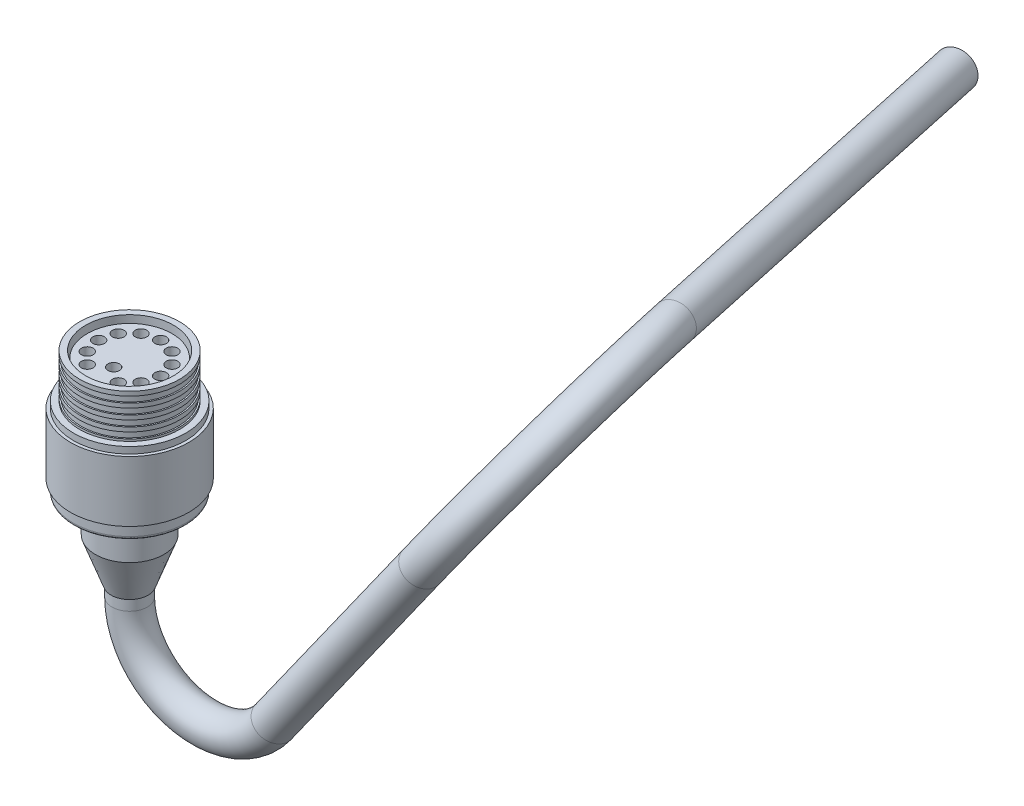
ISO-10303-21;
HEADER;
FILE_DESCRIPTION(('STEP AP214'),'2;1');
FILE_NAME('part.step','',(''),(''),'','','');
FILE_SCHEMA(('AUTOMOTIVE_DESIGN { 1 0 10303 214 1 1 1 1 }'));
ENDSEC;
DATA;
#1=APPLICATION_CONTEXT('core data for automotive mechanical design processes');
#2=APPLICATION_PROTOCOL_DEFINITION('international standard','automotive_design',2000,#1);
#3=PRODUCT_CONTEXT('',#1,'mechanical');
#4=PRODUCT('Part','Part','',(#3));
#5=PRODUCT_RELATED_PRODUCT_CATEGORY('part','',(#4));
#6=PRODUCT_DEFINITION_FORMATION('','',#4);
#7=PRODUCT_DEFINITION_CONTEXT('part definition',#1,'design');
#8=PRODUCT_DEFINITION('design','',#6,#7);
#9=PRODUCT_DEFINITION_SHAPE('','',#8);
#10=(LENGTH_UNIT() NAMED_UNIT(*) SI_UNIT(.MILLI.,.METRE.));
#11=(NAMED_UNIT(*) PLANE_ANGLE_UNIT() SI_UNIT($,.RADIAN.));
#12=(NAMED_UNIT(*) SI_UNIT($,.STERADIAN.) SOLID_ANGLE_UNIT());
#13=UNCERTAINTY_MEASURE_WITH_UNIT(LENGTH_MEASURE(1.E-05),#10,'distance_accuracy_value','');
#14=(GEOMETRIC_REPRESENTATION_CONTEXT(3) GLOBAL_UNCERTAINTY_ASSIGNED_CONTEXT((#13)) GLOBAL_UNIT_ASSIGNED_CONTEXT((#10,
#11,#12)) REPRESENTATION_CONTEXT('',''));
#15=CARTESIAN_POINT('',(0.,0.,0.));
#16=DIRECTION('',(0.,0.,1.));
#17=DIRECTION('',(1.,0.,0.));
#18=AXIS2_PLACEMENT_3D('',#15,#16,#17);
#19=CARTESIAN_POINT('',(0.,0.,0.));
#20=DIRECTION('',(0.,1.,0.));
#21=DIRECTION('',(0.,0.,1.));
#22=AXIS2_PLACEMENT_3D('',#19,#20,#21);
#23=CYLINDRICAL_SURFACE('',#22,12.954);
#24=CARTESIAN_POINT('',(0.,10.2451785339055,0.));
#25=DIRECTION('',(0.,1.,0.));
#26=DIRECTION('',(0.,0.,1.));
#27=AXIS2_PLACEMENT_3D('',#24,#25,#26);
#28=CIRCLE('',#27,12.954);
#29=CARTESIAN_POINT('',(0.,10.2451785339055,12.954));
#30=VERTEX_POINT('',#29);
#31=EDGE_CURVE('E143',#30,#30,#28,.T.);
#32=ORIENTED_EDGE('',*,*,#31,.F.);
#33=EDGE_LOOP('',(#32));
#34=FACE_BOUND('',#33,.T.);
#35=CARTESIAN_POINT('',(0.,14.5631785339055,0.));
#36=DIRECTION('',(0.,1.,0.));
#37=DIRECTION('',(0.,0.,1.));
#38=AXIS2_PLACEMENT_3D('',#35,#36,#37);
#39=CIRCLE('',#38,12.954);
#40=CARTESIAN_POINT('',(0.,14.5631785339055,12.954));
#41=VERTEX_POINT('',#40);
#42=EDGE_CURVE('E11',#41,#41,#39,.T.);
#43=ORIENTED_EDGE('',*,*,#42,.T.);
#44=EDGE_LOOP('',(#43));
#45=FACE_BOUND('',#44,.T.);
#46=ADVANCED_FACE('F46',(#34,#45),#23,.F.);
#47=CARTESIAN_POINT('',(12.954,14.5631785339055,0.));
#48=DIRECTION('',(0.,1.,0.));
#49=DIRECTION('',(0.,0.,1.));
#50=AXIS2_PLACEMENT_3D('',#47,#48,#49);
#51=PLANE('',#50);
#52=ORIENTED_EDGE('',*,*,#42,.F.);
#53=EDGE_LOOP('',(#52));
#54=FACE_BOUND('',#53,.T.);
#55=CARTESIAN_POINT('',(0.,14.5631785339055,0.));
#56=DIRECTION('',(0.,1.,0.));
#57=DIRECTION('',(0.,0.,1.));
#58=AXIS2_PLACEMENT_3D('',#55,#56,#57);
#59=CIRCLE('',#58,11.6205);
#60=CARTESIAN_POINT('',(0.,14.5631785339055,11.6205));
#61=VERTEX_POINT('',#60);
#62=EDGE_CURVE('E52',#61,#61,#59,.T.);
#63=ORIENTED_EDGE('',*,*,#62,.T.);
#64=EDGE_LOOP('',(#63));
#65=FACE_BOUND('',#64,.T.);
#66=ADVANCED_FACE('F150',(#54,#65),#51,.F.);
#67=CARTESIAN_POINT('',(0.,0.,0.));
#68=DIRECTION('',(0.,1.,0.));
#69=DIRECTION('',(0.,0.,1.));
#70=AXIS2_PLACEMENT_3D('',#67,#68,#69);
#71=CYLINDRICAL_SURFACE('',#70,11.6205);
#72=ORIENTED_EDGE('',*,*,#62,.F.);
#73=EDGE_LOOP('',(#72));
#74=FACE_BOUND('',#73,.T.);
#75=CARTESIAN_POINT('',(0.,15.4440239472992,0.));
#76=DIRECTION('',(0.,1.,0.));
#77=DIRECTION('',(0.,0.,1.));
#78=AXIS2_PLACEMENT_3D('',#75,#76,#77);
#79=CIRCLE('',#78,11.6205);
#80=CARTESIAN_POINT('',(0.,15.4440239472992,11.6205));
#81=VERTEX_POINT('',#80);
#82=EDGE_CURVE('E56',#81,#81,#79,.T.);
#83=ORIENTED_EDGE('',*,*,#82,.T.);
#84=EDGE_LOOP('',(#83));
#85=FACE_BOUND('',#84,.T.);
#86=ADVANCED_FACE('F154',(#74,#85),#71,.F.);
#87=CARTESIAN_POINT('',(11.6205,15.4440239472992,0.));
#88=DIRECTION('',(0.,-1.,0.));
#89=DIRECTION('',(0.,0.,-1.));
#90=AXIS2_PLACEMENT_3D('',#87,#88,#89);
#91=PLANE('',#90);
#92=ORIENTED_EDGE('',*,*,#82,.F.);
#93=EDGE_LOOP('',(#92));
#94=FACE_BOUND('',#93,.T.);
#95=CARTESIAN_POINT('',(0.,15.4440239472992,0.));
#96=DIRECTION('',(0.,1.,0.));
#97=DIRECTION('',(0.,0.,1.));
#98=AXIS2_PLACEMENT_3D('',#95,#96,#97);
#99=CIRCLE('',#98,12.954);
#100=CARTESIAN_POINT('',(0.,15.4440239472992,12.954));
#101=VERTEX_POINT('',#100);
#102=EDGE_CURVE('E60',#101,#101,#99,.T.);
#103=ORIENTED_EDGE('',*,*,#102,.T.);
#104=EDGE_LOOP('',(#103));
#105=FACE_BOUND('',#104,.T.);
#106=ADVANCED_FACE('F159',(#94,#105),#91,.F.);
#107=CARTESIAN_POINT('',(0.,0.,0.));
#108=DIRECTION('',(0.,1.,0.));
#109=DIRECTION('',(0.,0.,1.));
#110=AXIS2_PLACEMENT_3D('',#107,#108,#109);
#111=CYLINDRICAL_SURFACE('',#110,12.954);
#112=ORIENTED_EDGE('',*,*,#102,.F.);
#113=EDGE_LOOP('',(#112));
#114=FACE_BOUND('',#113,.T.);
#115=CARTESIAN_POINT('',(0.,47.0751785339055,0.));
#116=DIRECTION('',(0.,1.,0.));
#117=DIRECTION('',(0.,0.,1.));
#118=AXIS2_PLACEMENT_3D('',#115,#116,#117);
#119=CIRCLE('',#118,12.954);
#120=CARTESIAN_POINT('',(0.,47.0751785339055,12.954));
#121=VERTEX_POINT('',#120);
#122=EDGE_CURVE('E65',#121,#121,#119,.T.);
#123=ORIENTED_EDGE('',*,*,#122,.T.);
#124=EDGE_LOOP('',(#123));
#125=FACE_BOUND('',#124,.T.);
#126=ADVANCED_FACE('F165',(#114,#125),#111,.F.);
#127=CARTESIAN_POINT('',(14.732,47.0751785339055,0.));
#128=DIRECTION('',(0.,-1.,0.));
#129=DIRECTION('',(0.,0.,-1.));
#130=AXIS2_PLACEMENT_3D('',#127,#128,#129);
#131=PLANE('',#130);
#132=ORIENTED_EDGE('',*,*,#122,.F.);
#133=EDGE_LOOP('',(#132));
#134=FACE_BOUND('',#133,.T.);
#135=CARTESIAN_POINT('',(0.,47.0751785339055,0.));
#136=DIRECTION('',(0.,1.,0.));
#137=DIRECTION('',(0.,0.,1.));
#138=AXIS2_PLACEMENT_3D('',#135,#136,#137);
#139=CIRCLE('',#138,14.732);
#140=CARTESIAN_POINT('',(0.,47.0751785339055,14.732));
#141=VERTEX_POINT('',#140);
#142=EDGE_CURVE('E68',#141,#141,#139,.T.);
#143=ORIENTED_EDGE('',*,*,#142,.T.);
#144=EDGE_LOOP('',(#143));
#145=FACE_BOUND('',#144,.T.);
#146=ADVANCED_FACE('F169',(#134,#145),#131,.F.);
#147=CARTESIAN_POINT('',(0.,0.,0.));
#148=DIRECTION('',(0.,1.,0.));
#149=DIRECTION('',(0.,0.,1.));
#150=AXIS2_PLACEMENT_3D('',#147,#148,#149);
#151=CYLINDRICAL_SURFACE('',#150,14.732);
#152=ORIENTED_EDGE('',*,*,#142,.F.);
#153=EDGE_LOOP('',(#152));
#154=FACE_BOUND('',#153,.T.);
#155=CARTESIAN_POINT('',(0.,45.8051785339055,0.));
#156=DIRECTION('',(0.,1.,0.));
#157=DIRECTION('',(0.,0.,1.));
#158=AXIS2_PLACEMENT_3D('',#155,#156,#157);
#159=CIRCLE('',#158,14.732);
#160=CARTESIAN_POINT('',(0.,45.8051785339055,14.732));
#161=VERTEX_POINT('',#160);
#162=EDGE_CURVE('E71',#161,#161,#159,.T.);
#163=ORIENTED_EDGE('',*,*,#162,.T.);
#164=EDGE_LOOP('',(#163));
#165=FACE_BOUND('',#164,.T.);
#166=ADVANCED_FACE('F173',(#154,#165),#151,.T.);
#167=CARTESIAN_POINT('',(14.732,45.8051785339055,0.));
#168=DIRECTION('',(0.,1.,0.));
#169=DIRECTION('',(0.,0.,1.));
#170=AXIS2_PLACEMENT_3D('',#167,#168,#169);
#171=PLANE('',#170);
#172=ORIENTED_EDGE('',*,*,#162,.F.);
#173=EDGE_LOOP('',(#172));
#174=FACE_BOUND('',#173,.T.);
#175=CARTESIAN_POINT('',(0.,45.8051785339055,0.));
#176=DIRECTION('',(0.,1.,0.));
#177=DIRECTION('',(0.,0.,1.));
#178=AXIS2_PLACEMENT_3D('',#175,#176,#177);
#179=CIRCLE('',#178,14.3243451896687);
#180=CARTESIAN_POINT('',(0.,45.8051785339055,14.3243451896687));
#181=VERTEX_POINT('',#180);
#182=EDGE_CURVE('E74',#181,#181,#179,.T.);
#183=ORIENTED_EDGE('',*,*,#182,.T.);
#184=EDGE_LOOP('',(#183));
#185=FACE_BOUND('',#184,.T.);
#186=ADVANCED_FACE('F177',(#174,#185),#171,.F.);
#187=CARTESIAN_POINT('',(0.,0.,0.));
#188=DIRECTION('',(0.,1.,0.));
#189=DIRECTION('',(0.,0.,1.));
#190=AXIS2_PLACEMENT_3D('',#187,#188,#189);
#191=CYLINDRICAL_SURFACE('',#190,14.3243451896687);
#192=ORIENTED_EDGE('',*,*,#182,.F.);
#193=EDGE_LOOP('',(#192));
#194=FACE_BOUND('',#193,.T.);
#195=CARTESIAN_POINT('',(0.,44.0271785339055,0.));
#196=DIRECTION('',(0.,1.,0.));
#197=DIRECTION('',(0.,0.,1.));
#198=AXIS2_PLACEMENT_3D('',#195,#196,#197);
#199=CIRCLE('',#198,14.3243451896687);
#200=CARTESIAN_POINT('',(0.,44.0271785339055,14.3243451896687));
#201=VERTEX_POINT('',#200);
#202=EDGE_CURVE('E77',#201,#201,#199,.T.);
#203=ORIENTED_EDGE('',*,*,#202,.T.);
#204=EDGE_LOOP('',(#203));
#205=FACE_BOUND('',#204,.T.);
#206=ADVANCED_FACE('F181',(#194,#205),#191,.T.);
#207=CARTESIAN_POINT('',(14.3243451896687,44.0271785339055,0.));
#208=DIRECTION('',(0.,-1.,0.));
#209=DIRECTION('',(0.,0.,-1.));
#210=AXIS2_PLACEMENT_3D('',#207,#208,#209);
#211=PLANE('',#210);
#212=ORIENTED_EDGE('',*,*,#202,.F.);
#213=EDGE_LOOP('',(#212));
#214=FACE_BOUND('',#213,.T.);
#215=CARTESIAN_POINT('',(0.,44.0271785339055,0.));
#216=DIRECTION('',(0.,1.,0.));
#217=DIRECTION('',(0.,0.,1.));
#218=AXIS2_PLACEMENT_3D('',#215,#216,#217);
#219=CIRCLE('',#218,14.732);
#220=CARTESIAN_POINT('',(0.,44.0271785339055,14.732));
#221=VERTEX_POINT('',#220);
#222=EDGE_CURVE('E80',#221,#221,#219,.T.);
#223=ORIENTED_EDGE('',*,*,#222,.T.);
#224=EDGE_LOOP('',(#223));
#225=FACE_BOUND('',#224,.T.);
#226=ADVANCED_FACE('F185',(#214,#225),#211,.F.);
#227=CARTESIAN_POINT('',(0.,0.,0.));
#228=DIRECTION('',(0.,1.,0.));
#229=DIRECTION('',(0.,0.,1.));
#230=AXIS2_PLACEMENT_3D('',#227,#228,#229);
#231=CYLINDRICAL_SURFACE('',#230,14.732);
#232=ORIENTED_EDGE('',*,*,#222,.F.);
#233=EDGE_LOOP('',(#232));
#234=FACE_BOUND('',#233,.T.);
#235=CARTESIAN_POINT('',(0.,42.7571785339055,0.));
#236=DIRECTION('',(0.,1.,0.));
#237=DIRECTION('',(0.,0.,1.));
#238=AXIS2_PLACEMENT_3D('',#235,#236,#237);
#239=CIRCLE('',#238,14.732);
#240=CARTESIAN_POINT('',(0.,42.7571785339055,14.732));
#241=VERTEX_POINT('',#240);
#242=EDGE_CURVE('E83',#241,#241,#239,.T.);
#243=ORIENTED_EDGE('',*,*,#242,.T.);
#244=EDGE_LOOP('',(#243));
#245=FACE_BOUND('',#244,.T.);
#246=ADVANCED_FACE('F189',(#234,#245),#231,.T.);
#247=CARTESIAN_POINT('',(14.732,42.7571785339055,0.));
#248=DIRECTION('',(0.,1.,0.));
#249=DIRECTION('',(0.,0.,1.));
#250=AXIS2_PLACEMENT_3D('',#247,#248,#249);
#251=PLANE('',#250);
#252=ORIENTED_EDGE('',*,*,#242,.F.);
#253=EDGE_LOOP('',(#252));
#254=FACE_BOUND('',#253,.T.);
#255=CARTESIAN_POINT('',(0.,42.7571785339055,0.));
#256=DIRECTION('',(0.,1.,0.));
#257=DIRECTION('',(0.,0.,1.));
#258=AXIS2_PLACEMENT_3D('',#255,#256,#257);
#259=CIRCLE('',#258,14.3243451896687);
#260=CARTESIAN_POINT('',(0.,42.7571785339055,14.3243451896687));
#261=VERTEX_POINT('',#260);
#262=EDGE_CURVE('E86',#261,#261,#259,.T.);
#263=ORIENTED_EDGE('',*,*,#262,.T.);
#264=EDGE_LOOP('',(#263));
#265=FACE_BOUND('',#264,.T.);
#266=ADVANCED_FACE('F193',(#254,#265),#251,.F.);
#267=CARTESIAN_POINT('',(0.,0.,0.));
#268=DIRECTION('',(0.,1.,0.));
#269=DIRECTION('',(0.,0.,1.));
#270=AXIS2_PLACEMENT_3D('',#267,#268,#269);
#271=CYLINDRICAL_SURFACE('',#270,14.3243451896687);
#272=ORIENTED_EDGE('',*,*,#262,.F.);
#273=EDGE_LOOP('',(#272));
#274=FACE_BOUND('',#273,.T.);
#275=CARTESIAN_POINT('',(0.,40.9791785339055,0.));
#276=DIRECTION('',(0.,1.,0.));
#277=DIRECTION('',(0.,0.,1.));
#278=AXIS2_PLACEMENT_3D('',#275,#276,#277);
#279=CIRCLE('',#278,14.3243451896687);
#280=CARTESIAN_POINT('',(0.,40.9791785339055,14.3243451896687));
#281=VERTEX_POINT('',#280);
#282=EDGE_CURVE('E89',#281,#281,#279,.T.);
#283=ORIENTED_EDGE('',*,*,#282,.T.);
#284=EDGE_LOOP('',(#283));
#285=FACE_BOUND('',#284,.T.);
#286=ADVANCED_FACE('F197',(#274,#285),#271,.T.);
#287=CARTESIAN_POINT('',(14.3243451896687,40.9791785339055,0.));
#288=DIRECTION('',(0.,-1.,0.));
#289=DIRECTION('',(0.,0.,-1.));
#290=AXIS2_PLACEMENT_3D('',#287,#288,#289);
#291=PLANE('',#290);
#292=ORIENTED_EDGE('',*,*,#282,.F.);
#293=EDGE_LOOP('',(#292));
#294=FACE_BOUND('',#293,.T.);
#295=CARTESIAN_POINT('',(0.,40.9791785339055,0.));
#296=DIRECTION('',(0.,1.,0.));
#297=DIRECTION('',(0.,0.,1.));
#298=AXIS2_PLACEMENT_3D('',#295,#296,#297);
#299=CIRCLE('',#298,14.732);
#300=CARTESIAN_POINT('',(0.,40.9791785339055,14.732));
#301=VERTEX_POINT('',#300);
#302=EDGE_CURVE('E92',#301,#301,#299,.T.);
#303=ORIENTED_EDGE('',*,*,#302,.T.);
#304=EDGE_LOOP('',(#303));
#305=FACE_BOUND('',#304,.T.);
#306=ADVANCED_FACE('F201',(#294,#305),#291,.F.);
#307=CARTESIAN_POINT('',(0.,0.,0.));
#308=DIRECTION('',(0.,1.,0.));
#309=DIRECTION('',(0.,0.,1.));
#310=AXIS2_PLACEMENT_3D('',#307,#308,#309);
#311=CYLINDRICAL_SURFACE('',#310,14.732);
#312=ORIENTED_EDGE('',*,*,#302,.F.);
#313=EDGE_LOOP('',(#312));
#314=FACE_BOUND('',#313,.T.);
#315=CARTESIAN_POINT('',(0.,39.7091785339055,0.));
#316=DIRECTION('',(0.,1.,0.));
#317=DIRECTION('',(0.,0.,1.));
#318=AXIS2_PLACEMENT_3D('',#315,#316,#317);
#319=CIRCLE('',#318,14.732);
#320=CARTESIAN_POINT('',(0.,39.7091785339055,14.732));
#321=VERTEX_POINT('',#320);
#322=EDGE_CURVE('E95',#321,#321,#319,.T.);
#323=ORIENTED_EDGE('',*,*,#322,.T.);
#324=EDGE_LOOP('',(#323));
#325=FACE_BOUND('',#324,.T.);
#326=ADVANCED_FACE('F205',(#314,#325),#311,.T.);
#327=CARTESIAN_POINT('',(14.732,39.7091785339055,0.));
#328=DIRECTION('',(0.,1.,0.));
#329=DIRECTION('',(0.,0.,1.));
#330=AXIS2_PLACEMENT_3D('',#327,#328,#329);
#331=PLANE('',#330);
#332=ORIENTED_EDGE('',*,*,#322,.F.);
#333=EDGE_LOOP('',(#332));
#334=FACE_BOUND('',#333,.T.);
#335=CARTESIAN_POINT('',(0.,39.7091785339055,0.));
#336=DIRECTION('',(0.,1.,0.));
#337=DIRECTION('',(0.,0.,1.));
#338=AXIS2_PLACEMENT_3D('',#335,#336,#337);
#339=CIRCLE('',#338,14.3243451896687);
#340=CARTESIAN_POINT('',(0.,39.7091785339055,14.3243451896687));
#341=VERTEX_POINT('',#340);
#342=EDGE_CURVE('E98',#341,#341,#339,.T.);
#343=ORIENTED_EDGE('',*,*,#342,.T.);
#344=EDGE_LOOP('',(#343));
#345=FACE_BOUND('',#344,.T.);
#346=ADVANCED_FACE('F209',(#334,#345),#331,.F.);
#347=CARTESIAN_POINT('',(0.,0.,0.));
#348=DIRECTION('',(0.,1.,0.));
#349=DIRECTION('',(0.,0.,1.));
#350=AXIS2_PLACEMENT_3D('',#347,#348,#349);
#351=CYLINDRICAL_SURFACE('',#350,14.3243451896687);
#352=ORIENTED_EDGE('',*,*,#342,.F.);
#353=EDGE_LOOP('',(#352));
#354=FACE_BOUND('',#353,.T.);
#355=CARTESIAN_POINT('',(0.,37.9311785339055,0.));
#356=DIRECTION('',(0.,1.,0.));
#357=DIRECTION('',(0.,0.,1.));
#358=AXIS2_PLACEMENT_3D('',#355,#356,#357);
#359=CIRCLE('',#358,14.3243451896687);
#360=CARTESIAN_POINT('',(0.,37.9311785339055,14.3243451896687));
#361=VERTEX_POINT('',#360);
#362=EDGE_CURVE('E101',#361,#361,#359,.T.);
#363=ORIENTED_EDGE('',*,*,#362,.T.);
#364=EDGE_LOOP('',(#363));
#365=FACE_BOUND('',#364,.T.);
#366=ADVANCED_FACE('F213',(#354,#365),#351,.T.);
#367=CARTESIAN_POINT('',(14.3243451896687,37.9311785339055,0.));
#368=DIRECTION('',(0.,-1.,0.));
#369=DIRECTION('',(0.,0.,-1.));
#370=AXIS2_PLACEMENT_3D('',#367,#368,#369);
#371=PLANE('',#370);
#372=ORIENTED_EDGE('',*,*,#362,.F.);
#373=EDGE_LOOP('',(#372));
#374=FACE_BOUND('',#373,.T.);
#375=CARTESIAN_POINT('',(0.,37.9311785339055,0.));
#376=DIRECTION('',(0.,1.,0.));
#377=DIRECTION('',(0.,0.,1.));
#378=AXIS2_PLACEMENT_3D('',#375,#376,#377);
#379=CIRCLE('',#378,14.732);
#380=CARTESIAN_POINT('',(0.,37.9311785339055,14.732));
#381=VERTEX_POINT('',#380);
#382=EDGE_CURVE('E104',#381,#381,#379,.T.);
#383=ORIENTED_EDGE('',*,*,#382,.T.);
#384=EDGE_LOOP('',(#383));
#385=FACE_BOUND('',#384,.T.);
#386=ADVANCED_FACE('F217',(#374,#385),#371,.F.);
#387=CARTESIAN_POINT('',(0.,0.,0.));
#388=DIRECTION('',(0.,1.,0.));
#389=DIRECTION('',(0.,0.,1.));
#390=AXIS2_PLACEMENT_3D('',#387,#388,#389);
#391=CYLINDRICAL_SURFACE('',#390,14.732);
#392=ORIENTED_EDGE('',*,*,#382,.F.);
#393=EDGE_LOOP('',(#392));
#394=FACE_BOUND('',#393,.T.);
#395=CARTESIAN_POINT('',(0.,36.6611785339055,0.));
#396=DIRECTION('',(0.,1.,0.));
#397=DIRECTION('',(0.,0.,1.));
#398=AXIS2_PLACEMENT_3D('',#395,#396,#397);
#399=CIRCLE('',#398,14.732);
#400=CARTESIAN_POINT('',(0.,36.6611785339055,14.732));
#401=VERTEX_POINT('',#400);
#402=EDGE_CURVE('E107',#401,#401,#399,.T.);
#403=ORIENTED_EDGE('',*,*,#402,.T.);
#404=EDGE_LOOP('',(#403));
#405=FACE_BOUND('',#404,.T.);
#406=ADVANCED_FACE('F221',(#394,#405),#391,.T.);
#407=CARTESIAN_POINT('',(14.732,36.6611785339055,0.));
#408=DIRECTION('',(0.,1.,0.));
#409=DIRECTION('',(0.,0.,1.));
#410=AXIS2_PLACEMENT_3D('',#407,#408,#409);
#411=PLANE('',#410);
#412=ORIENTED_EDGE('',*,*,#402,.F.);
#413=EDGE_LOOP('',(#412));
#414=FACE_BOUND('',#413,.T.);
#415=CARTESIAN_POINT('',(0.,36.6611785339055,0.));
#416=DIRECTION('',(0.,1.,0.));
#417=DIRECTION('',(0.,0.,1.));
#418=AXIS2_PLACEMENT_3D('',#415,#416,#417);
#419=CIRCLE('',#418,14.3243451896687);
#420=CARTESIAN_POINT('',(0.,36.6611785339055,14.3243451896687));
#421=VERTEX_POINT('',#420);
#422=EDGE_CURVE('E110',#421,#421,#419,.T.);
#423=ORIENTED_EDGE('',*,*,#422,.T.);
#424=EDGE_LOOP('',(#423));
#425=FACE_BOUND('',#424,.T.);
#426=ADVANCED_FACE('F225',(#414,#425),#411,.F.);
#427=CARTESIAN_POINT('',(0.,0.,0.));
#428=DIRECTION('',(0.,1.,0.));
#429=DIRECTION('',(0.,0.,1.));
#430=AXIS2_PLACEMENT_3D('',#427,#428,#429);
#431=CYLINDRICAL_SURFACE('',#430,14.3243451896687);
#432=ORIENTED_EDGE('',*,*,#422,.F.);
#433=EDGE_LOOP('',(#432));
#434=FACE_BOUND('',#433,.T.);
#435=CARTESIAN_POINT('',(0.,34.8831785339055,0.));
#436=DIRECTION('',(0.,1.,0.));
#437=DIRECTION('',(0.,0.,1.));
#438=AXIS2_PLACEMENT_3D('',#435,#436,#437);
#439=CIRCLE('',#438,14.3243451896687);
#440=CARTESIAN_POINT('',(0.,34.8831785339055,14.3243451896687));
#441=VERTEX_POINT('',#440);
#442=EDGE_CURVE('E113',#441,#441,#439,.T.);
#443=ORIENTED_EDGE('',*,*,#442,.T.);
#444=EDGE_LOOP('',(#443));
#445=FACE_BOUND('',#444,.T.);
#446=ADVANCED_FACE('F229',(#434,#445),#431,.T.);
#447=CARTESIAN_POINT('',(14.3243451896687,34.8831785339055,0.));
#448=DIRECTION('',(0.,-1.,0.));
#449=DIRECTION('',(0.,0.,-1.));
#450=AXIS2_PLACEMENT_3D('',#447,#448,#449);
#451=PLANE('',#450);
#452=ORIENTED_EDGE('',*,*,#442,.F.);
#453=EDGE_LOOP('',(#452));
#454=FACE_BOUND('',#453,.T.);
#455=CARTESIAN_POINT('',(0.,34.8831785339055,0.));
#456=DIRECTION('',(0.,1.,0.));
#457=DIRECTION('',(0.,0.,1.));
#458=AXIS2_PLACEMENT_3D('',#455,#456,#457);
#459=CIRCLE('',#458,14.732);
#460=CARTESIAN_POINT('',(0.,34.8831785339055,14.732));
#461=VERTEX_POINT('',#460);
#462=EDGE_CURVE('E116',#461,#461,#459,.T.);
#463=ORIENTED_EDGE('',*,*,#462,.T.);
#464=EDGE_LOOP('',(#463));
#465=FACE_BOUND('',#464,.T.);
#466=ADVANCED_FACE('F233',(#454,#465),#451,.F.);
#467=CARTESIAN_POINT('',(0.,0.,0.));
#468=DIRECTION('',(0.,1.,0.));
#469=DIRECTION('',(0.,0.,1.));
#470=AXIS2_PLACEMENT_3D('',#467,#468,#469);
#471=CYLINDRICAL_SURFACE('',#470,14.732);
#472=ORIENTED_EDGE('',*,*,#462,.F.);
#473=EDGE_LOOP('',(#472));
#474=FACE_BOUND('',#473,.T.);
#475=CARTESIAN_POINT('',(0.,34.2451785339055,0.));
#476=DIRECTION('',(0.,1.,0.));
#477=DIRECTION('',(0.,0.,1.));
#478=AXIS2_PLACEMENT_3D('',#475,#476,#477);
#479=CIRCLE('',#478,14.732);
#480=CARTESIAN_POINT('',(0.,34.2451785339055,14.732));
#481=VERTEX_POINT('',#480);
#482=EDGE_CURVE('E119',#481,#481,#479,.T.);
#483=ORIENTED_EDGE('',*,*,#482,.T.);
#484=EDGE_LOOP('',(#483));
#485=FACE_BOUND('',#484,.T.);
#486=ADVANCED_FACE('F237',(#474,#485),#471,.T.);
#487=CARTESIAN_POINT('',(16.5608,34.2451785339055,0.));
#488=DIRECTION('',(0.,-1.,0.));
#489=DIRECTION('',(0.,0.,-1.));
#490=AXIS2_PLACEMENT_3D('',#487,#488,#489);
#491=PLANE('',#490);
#492=ORIENTED_EDGE('',*,*,#482,.F.);
#493=EDGE_LOOP('',(#492));
#494=FACE_BOUND('',#493,.T.);
#495=CARTESIAN_POINT('',(0.,34.2451785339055,0.));
#496=DIRECTION('',(0.,1.,0.));
#497=DIRECTION('',(0.,0.,1.));
#498=AXIS2_PLACEMENT_3D('',#495,#496,#497);
#499=CIRCLE('',#498,16.5608);
#500=CARTESIAN_POINT('',(0.,34.2451785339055,16.5608));
#501=VERTEX_POINT('',#500);
#502=EDGE_CURVE('E122',#501,#501,#499,.T.);
#503=ORIENTED_EDGE('',*,*,#502,.T.);
#504=EDGE_LOOP('',(#503));
#505=FACE_BOUND('',#504,.T.);
#506=ADVANCED_FACE('F241',(#494,#505),#491,.F.);
#507=CARTESIAN_POINT('',(0.,0.,0.));
#508=DIRECTION('',(0.,1.,0.));
#509=DIRECTION('',(0.,0.,1.));
#510=AXIS2_PLACEMENT_3D('',#507,#508,#509);
#511=CYLINDRICAL_SURFACE('',#510,16.5608);
#512=ORIENTED_EDGE('',*,*,#502,.F.);
#513=EDGE_LOOP('',(#512));
#514=FACE_BOUND('',#513,.T.);
#515=CARTESIAN_POINT('',(0.,32.3208076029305,0.));
#516=DIRECTION('',(0.,1.,0.));
#517=DIRECTION('',(0.,0.,1.));
#518=AXIS2_PLACEMENT_3D('',#515,#516,#517);
#519=CIRCLE('',#518,16.5608);
#520=CARTESIAN_POINT('',(0.,32.3208076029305,16.5608));
#521=VERTEX_POINT('',#520);
#522=EDGE_CURVE('E125',#521,#521,#519,.T.);
#523=ORIENTED_EDGE('',*,*,#522,.T.);
#524=EDGE_LOOP('',(#523));
#525=FACE_BOUND('',#524,.T.);
#526=ADVANCED_FACE('F245',(#514,#525),#511,.T.);
#527=CARTESIAN_POINT('',(16.5608,32.3208076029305,0.));
#528=DIRECTION('',(0.,-1.,0.));
#529=DIRECTION('',(0.,0.,-1.));
#530=AXIS2_PLACEMENT_3D('',#527,#528,#529);
#531=PLANE('',#530);
#532=ORIENTED_EDGE('',*,*,#522,.F.);
#533=EDGE_LOOP('',(#532));
#534=FACE_BOUND('',#533,.T.);
#535=CARTESIAN_POINT('',(0.,32.3208076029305,0.));
#536=DIRECTION('',(0.,1.,0.));
#537=DIRECTION('',(0.,0.,1.));
#538=AXIS2_PLACEMENT_3D('',#535,#536,#537);
#539=CIRCLE('',#538,17.4625);
#540=CARTESIAN_POINT('',(0.,32.3208076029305,17.4625));
#541=VERTEX_POINT('',#540);
#542=EDGE_CURVE('E128',#541,#541,#539,.T.);
#543=ORIENTED_EDGE('',*,*,#542,.T.);
#544=EDGE_LOOP('',(#543));
#545=FACE_BOUND('',#544,.T.);
#546=ADVANCED_FACE('F249',(#534,#545),#531,.F.);
#547=CARTESIAN_POINT('',(0.,0.,0.));
#548=DIRECTION('',(0.,1.,0.));
#549=DIRECTION('',(0.,0.,1.));
#550=AXIS2_PLACEMENT_3D('',#547,#548,#549);
#551=CYLINDRICAL_SURFACE('',#550,17.4625);
#552=ORIENTED_EDGE('',*,*,#542,.F.);
#553=EDGE_LOOP('',(#552));
#554=FACE_BOUND('',#553,.T.);
#555=CARTESIAN_POINT('',(0.,14.4475648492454,0.));
#556=DIRECTION('',(0.,1.,0.));
#557=DIRECTION('',(0.,0.,1.));
#558=AXIS2_PLACEMENT_3D('',#555,#556,#557);
#559=CIRCLE('',#558,17.4625);
#560=CARTESIAN_POINT('',(0.,14.4475648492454,17.4625));
#561=VERTEX_POINT('',#560);
#562=EDGE_CURVE('E131',#561,#561,#559,.T.);
#563=ORIENTED_EDGE('',*,*,#562,.T.);
#564=EDGE_LOOP('',(#563));
#565=FACE_BOUND('',#564,.T.);
#566=ADVANCED_FACE('F253',(#554,#565),#551,.T.);
#567=CARTESIAN_POINT('',(17.4625,14.4475648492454,0.));
#568=DIRECTION('',(0.,1.,0.));
#569=DIRECTION('',(0.,0.,1.));
#570=AXIS2_PLACEMENT_3D('',#567,#568,#569);
#571=PLANE('',#570);
#572=ORIENTED_EDGE('',*,*,#562,.F.);
#573=EDGE_LOOP('',(#572));
#574=FACE_BOUND('',#573,.T.);
#575=CARTESIAN_POINT('',(0.,14.4475648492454,0.));
#576=DIRECTION('',(0.,1.,0.));
#577=DIRECTION('',(0.,0.,1.));
#578=AXIS2_PLACEMENT_3D('',#575,#576,#577);
#579=CIRCLE('',#578,16.5608);
#580=CARTESIAN_POINT('',(0.,14.4475648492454,16.5608));
#581=VERTEX_POINT('',#580);
#582=EDGE_CURVE('E134',#581,#581,#579,.T.);
#583=ORIENTED_EDGE('',*,*,#582,.T.);
#584=EDGE_LOOP('',(#583));
#585=FACE_BOUND('',#584,.T.);
#586=ADVANCED_FACE('F257',(#574,#585),#571,.F.);
#587=CARTESIAN_POINT('',(0.,0.,0.));
#588=DIRECTION('',(0.,1.,0.));
#589=DIRECTION('',(0.,0.,1.));
#590=AXIS2_PLACEMENT_3D('',#587,#588,#589);
#591=CYLINDRICAL_SURFACE('',#590,16.5608);
#592=ORIENTED_EDGE('',*,*,#582,.F.);
#593=EDGE_LOOP('',(#592));
#594=FACE_BOUND('',#593,.T.);
#595=CARTESIAN_POINT('',(0.,11.2451785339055,0.));
#596=DIRECTION('',(0.,1.,0.));
#597=DIRECTION('',(0.,0.,1.));
#598=AXIS2_PLACEMENT_3D('',#595,#596,#597);
#599=CIRCLE('',#598,16.5608);
#600=CARTESIAN_POINT('',(0.,11.2451785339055,16.5608));
#601=VERTEX_POINT('',#600);
#602=EDGE_CURVE('E137',#601,#601,#599,.T.);
#603=ORIENTED_EDGE('',*,*,#602,.T.);
#604=EDGE_LOOP('',(#603));
#605=FACE_BOUND('',#604,.T.);
#606=ADVANCED_FACE('F261',(#594,#605),#591,.T.);
#607=CARTESIAN_POINT('',(0.,11.2451785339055,0.));
#608=DIRECTION('',(0.,1.,0.));
#609=DIRECTION('',(0.,0.,1.));
#610=AXIS2_PLACEMENT_3D('',#607,#608,#609);
#611=TOROIDAL_SURFACE('',#610,15.5608,1.);
#612=ORIENTED_EDGE('',*,*,#602,.F.);
#613=EDGE_LOOP('',(#612));
#614=FACE_BOUND('',#613,.T.);
#615=CARTESIAN_POINT('',(0.,10.2451785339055,0.));
#616=DIRECTION('',(0.,1.,0.));
#617=DIRECTION('',(0.,0.,1.));
#618=AXIS2_PLACEMENT_3D('',#615,#616,#617);
#619=CIRCLE('',#618,15.5608);
#620=CARTESIAN_POINT('',(0.,10.2451785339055,15.5608));
#621=VERTEX_POINT('',#620);
#622=EDGE_CURVE('E140',#621,#621,#619,.T.);
#623=ORIENTED_EDGE('',*,*,#622,.T.);
#624=EDGE_LOOP('',(#623));
#625=FACE_BOUND('',#624,.T.);
#626=ADVANCED_FACE('F265',(#614,#625),#611,.T.);
#627=CARTESIAN_POINT('',(12.954,10.2451785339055,0.));
#628=DIRECTION('',(0.,1.,0.));
#629=DIRECTION('',(0.,0.,1.));
#630=AXIS2_PLACEMENT_3D('',#627,#628,#629);
#631=PLANE('',#630);
#632=ORIENTED_EDGE('',*,*,#622,.F.);
#633=EDGE_LOOP('',(#632));
#634=FACE_BOUND('',#633,.T.);
#635=ORIENTED_EDGE('',*,*,#31,.T.);
#636=EDGE_LOOP('',(#635));
#637=FACE_BOUND('',#636,.T.);
#638=ADVANCED_FACE('F147',(#634,#637),#631,.F.);
#639=CLOSED_SHELL('',(#46,#66,#86,#106,#126,#146,#166,#186,#206,#226,#246,#266,#286,#306,#326,
#346,#366,#386,#406,#426,#446,#466,#486,#506,#526,#546,#566,#586,#606,#626,#638));
#640=MANIFOLD_SOLID_BREP('B2',#639);
#641=CARTESIAN_POINT('',(0.,-12.7,0.));
#642=DIRECTION('',(0.,-1.,0.));
#643=DIRECTION('',(0.,0.,-1.));
#644=AXIS2_PLACEMENT_3D('',#641,#642,#643);
#645=PLANE('',#644);
#646=CARTESIAN_POINT('',(0.,-12.7,0.));
#647=DIRECTION('',(0.,-1.,0.));
#648=DIRECTION('',(0.,0.,-1.));
#649=AXIS2_PLACEMENT_3D('',#646,#647,#648);
#650=CIRCLE('',#649,5.47407802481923);
#651=CARTESIAN_POINT('',(0.,-12.7,-5.47407802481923));
#652=VERTEX_POINT('',#651);
#653=EDGE_CURVE('E528',#652,#652,#650,.T.);
#654=ORIENTED_EDGE('',*,*,#653,.T.);
#655=EDGE_LOOP('',(#654));
#656=FACE_BOUND('',#655,.T.);
#657=CARTESIAN_POINT('',(0.,-12.7,0.));
#658=DIRECTION('',(0.,-1.,0.));
#659=DIRECTION('',(0.,0.,-1.));
#660=AXIS2_PLACEMENT_3D('',#657,#658,#659);
#661=CIRCLE('',#660,5.207);
#662=CARTESIAN_POINT('',(0.,-12.7,-5.207));
#663=VERTEX_POINT('',#662);
#664=EDGE_CURVE('E536',#663,#663,#661,.T.);
#665=ORIENTED_EDGE('',*,*,#664,.F.);
#666=EDGE_LOOP('',(#665));
#667=FACE_BOUND('',#666,.T.);
#668=ADVANCED_FACE('F512',(#656,#667),#645,.T.);
#669=CARTESIAN_POINT('',(0.,17.145,0.));
#670=DIRECTION('',(0.,-1.,0.));
#671=DIRECTION('',(0.,0.,-1.));
#672=AXIS2_PLACEMENT_3D('',#669,#670,#671);
#673=CYLINDRICAL_SURFACE('',#672,10.0965);
#674=CARTESIAN_POINT('',(0.,17.145,0.));
#675=DIRECTION('',(0.,1.,0.));
#676=DIRECTION('',(0.,0.,1.));
#677=AXIS2_PLACEMENT_3D('',#674,#675,#676);
#678=CIRCLE('',#677,10.0965);
#679=CARTESIAN_POINT('',(0.,17.145,10.0965));
#680=VERTEX_POINT('',#679);
#681=EDGE_CURVE('E45',#680,#680,#678,.T.);
#682=ORIENTED_EDGE('',*,*,#681,.F.);
#683=EDGE_LOOP('',(#682));
#684=FACE_BOUND('',#683,.T.);
#685=CARTESIAN_POINT('',(0.,0.,0.));
#686=DIRECTION('',(0.,-1.,0.));
#687=DIRECTION('',(0.,0.,-1.));
#688=AXIS2_PLACEMENT_3D('',#685,#686,#687);
#689=CIRCLE('',#688,10.0965);
#690=CARTESIAN_POINT('',(0.,0.,-10.0965));
#691=VERTEX_POINT('',#690);
#692=EDGE_CURVE('E532',#691,#691,#689,.T.);
#693=ORIENTED_EDGE('',*,*,#692,.F.);
#694=EDGE_LOOP('',(#693));
#695=FACE_BOUND('',#694,.T.);
#696=ADVANCED_FACE('F514',(#684,#695),#673,.T.);
#697=CARTESIAN_POINT('',(0.,17.145,0.));
#698=DIRECTION('',(0.,1.,0.));
#699=DIRECTION('',(0.,0.,1.));
#700=AXIS2_PLACEMENT_3D('',#697,#698,#699);
#701=PLANE('',#700);
#702=CARTESIAN_POINT('',(0.,17.145,0.));
#703=DIRECTION('',(0.,1.,0.));
#704=DIRECTION('',(0.,0.,1.));
#705=AXIS2_PLACEMENT_3D('',#702,#703,#704);
#706=CIRCLE('',#705,12.5);
#707=CARTESIAN_POINT('',(0.,17.145,12.5));
#708=VERTEX_POINT('',#707);
#709=EDGE_CURVE('E523',#708,#708,#706,.T.);
#710=ORIENTED_EDGE('',*,*,#709,.F.);
#711=EDGE_LOOP('',(#710));
#712=FACE_BOUND('',#711,.T.);
#713=ORIENTED_EDGE('',*,*,#681,.T.);
#714=EDGE_LOOP('',(#713));
#715=FACE_BOUND('',#714,.T.);
#716=ADVANCED_FACE('F668',(#712,#715),#701,.F.);
#717=CARTESIAN_POINT('',(0.,45.145,0.));
#718=DIRECTION('',(0.,-1.,0.));
#719=DIRECTION('',(0.,0.,-1.));
#720=AXIS2_PLACEMENT_3D('',#717,#718,#719);
#721=CYLINDRICAL_SURFACE('',#720,12.5);
#722=CARTESIAN_POINT('',(0.,45.145,0.));
#723=DIRECTION('',(0.,1.,0.));
#724=DIRECTION('',(0.,0.,1.));
#725=AXIS2_PLACEMENT_3D('',#722,#723,#724);
#726=CIRCLE('',#725,12.5);
#727=CARTESIAN_POINT('',(0.,45.145,12.5));
#728=VERTEX_POINT('',#727);
#729=EDGE_CURVE('E519',#728,#728,#726,.T.);
#730=ORIENTED_EDGE('',*,*,#729,.F.);
#731=EDGE_LOOP('',(#730));
#732=FACE_BOUND('',#731,.T.);
#733=ORIENTED_EDGE('',*,*,#709,.T.);
#734=EDGE_LOOP('',(#733));
#735=FACE_BOUND('',#734,.T.);
#736=ADVANCED_FACE('F678',(#732,#735),#721,.T.);
#737=CARTESIAN_POINT('',(0.,45.145,0.));
#738=DIRECTION('',(0.,1.,0.));
#739=DIRECTION('',(0.,0.,1.));
#740=AXIS2_PLACEMENT_3D('',#737,#738,#739);
#741=PLANE('',#740);
#742=CARTESIAN_POINT('',(0.,45.145,4.689778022));
#743=DIRECTION('',(0.,1.,0.));
#744=DIRECTION('',(0.,0.,1.));
#745=AXIS2_PLACEMENT_3D('',#742,#743,#744);
#746=CIRCLE('',#745,1.7145);
#747=CARTESIAN_POINT('',(0.,45.145,6.404278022));
#748=VERTEX_POINT('',#747);
#749=EDGE_CURVE('E608',#748,#748,#746,.T.);
#750=ORIENTED_EDGE('',*,*,#749,.F.);
#751=EDGE_LOOP('',(#750));
#752=FACE_BOUND('',#751,.T.);
#753=CARTESIAN_POINT('',(-4.5719999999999,45.145,-7.91893629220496));
#754=DIRECTION('',(0.,1.,0.));
#755=DIRECTION('',(0.499999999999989,0.,0.866025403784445));
#756=AXIS2_PLACEMENT_3D('',#753,#754,#755);
#757=CIRCLE('',#756,1.7145);
#758=CARTESIAN_POINT('',(-3.71474999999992,45.145,-6.43413573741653));
#759=VERTEX_POINT('',#758);
#760=EDGE_CURVE('E604',#759,#759,#757,.T.);
#761=ORIENTED_EDGE('',*,*,#760,.F.);
#762=EDGE_LOOP('',(#761));
#763=FACE_BOUND('',#762,.T.);
#764=CARTESIAN_POINT('',(-7.91893629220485,45.145,-4.57200000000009));
#765=DIRECTION('',(0.,1.,0.));
#766=DIRECTION('',(0.866025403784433,0.,0.50000000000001));
#767=AXIS2_PLACEMENT_3D('',#764,#765,#766);
#768=CIRCLE('',#767,1.7145);
#769=CARTESIAN_POINT('',(-6.43413573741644,45.145,-3.71475000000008));
#770=VERTEX_POINT('',#769);
#771=EDGE_CURVE('E598',#770,#770,#768,.T.);
#772=ORIENTED_EDGE('',*,*,#771,.F.);
#773=EDGE_LOOP('',(#772));
#774=FACE_BOUND('',#773,.T.);
#775=CARTESIAN_POINT('',(-9.144,45.145,0.));
#776=DIRECTION('',(0.,1.,0.));
#777=DIRECTION('',(1.,0.,0.));
#778=AXIS2_PLACEMENT_3D('',#775,#776,#777);
#779=CIRCLE('',#778,1.7145);
#780=CARTESIAN_POINT('',(-7.4295,45.145,0.));
#781=VERTEX_POINT('',#780);
#782=EDGE_CURVE('E592',#781,#781,#779,.T.);
#783=ORIENTED_EDGE('',*,*,#782,.F.);
#784=EDGE_LOOP('',(#783));
#785=FACE_BOUND('',#784,.T.);
#786=CARTESIAN_POINT('',(-7.91893629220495,45.145,4.57199999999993));
#787=DIRECTION('',(0.,1.,0.));
#788=DIRECTION('',(0.866025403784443,0.,-0.499999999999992));
#789=AXIS2_PLACEMENT_3D('',#786,#787,#788);
#790=CIRCLE('',#789,1.7145);
#791=CARTESIAN_POINT('',(-6.43413573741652,45.145,3.71474999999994));
#792=VERTEX_POINT('',#791);
#793=EDGE_CURVE('E586',#792,#792,#790,.T.);
#794=ORIENTED_EDGE('',*,*,#793,.F.);
#795=EDGE_LOOP('',(#794));
#796=FACE_BOUND('',#795,.T.);
#797=CARTESIAN_POINT('',(-4.57200000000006,45.145,7.91893629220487));
#798=DIRECTION('',(0.,1.,0.));
#799=DIRECTION('',(0.500000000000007,0.,-0.866025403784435));
#800=AXIS2_PLACEMENT_3D('',#797,#798,#799);
#801=CIRCLE('',#800,1.7145);
#802=CARTESIAN_POINT('',(-3.71475000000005,45.145,6.43413573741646));
#803=VERTEX_POINT('',#802);
#804=EDGE_CURVE('E580',#803,#803,#801,.T.);
#805=ORIENTED_EDGE('',*,*,#804,.F.);
#806=EDGE_LOOP('',(#805));
#807=FACE_BOUND('',#806,.T.);
#808=CARTESIAN_POINT('',(4.57199999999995,45.145,7.91893629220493));
#809=DIRECTION('',(0.,1.,0.));
#810=DIRECTION('',(-0.499999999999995,0.,-0.866025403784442));
#811=AXIS2_PLACEMENT_3D('',#808,#809,#810);
#812=CIRCLE('',#811,1.7145);
#813=CARTESIAN_POINT('',(3.71474999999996,45.145,6.43413573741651));
#814=VERTEX_POINT('',#813);
#815=EDGE_CURVE('E574',#814,#814,#812,.T.);
#816=ORIENTED_EDGE('',*,*,#815,.F.);
#817=EDGE_LOOP('',(#816));
#818=FACE_BOUND('',#817,.T.);
#819=CARTESIAN_POINT('',(7.91893629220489,45.145,4.57200000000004));
#820=DIRECTION('',(0.,1.,0.));
#821=DIRECTION('',(-0.866025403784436,0.,-0.500000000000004));
#822=AXIS2_PLACEMENT_3D('',#819,#820,#821);
#823=CIRCLE('',#822,1.7145);
#824=CARTESIAN_POINT('',(6.43413573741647,45.145,3.71475000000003));
#825=VERTEX_POINT('',#824);
#826=EDGE_CURVE('E568',#825,#825,#823,.T.);
#827=ORIENTED_EDGE('',*,*,#826,.F.);
#828=EDGE_LOOP('',(#827));
#829=FACE_BOUND('',#828,.T.);
#830=CARTESIAN_POINT('',(9.144,45.145,0.));
#831=DIRECTION('',(0.,1.,0.));
#832=DIRECTION('',(-1.,0.,0.));
#833=AXIS2_PLACEMENT_3D('',#830,#831,#832);
#834=CIRCLE('',#833,1.7145);
#835=CARTESIAN_POINT('',(7.4295,45.145,0.));
#836=VERTEX_POINT('',#835);
#837=EDGE_CURVE('E562',#836,#836,#834,.T.);
#838=ORIENTED_EDGE('',*,*,#837,.F.);
#839=EDGE_LOOP('',(#838));
#840=FACE_BOUND('',#839,.T.);
#841=CARTESIAN_POINT('',(7.91893629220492,45.145,-4.57199999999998));
#842=DIRECTION('',(0.,1.,0.));
#843=DIRECTION('',(-0.86602540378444,0.,0.499999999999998));
#844=AXIS2_PLACEMENT_3D('',#841,#842,#843);
#845=CIRCLE('',#844,1.7145);
#846=CARTESIAN_POINT('',(6.4341357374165,45.145,-3.71474999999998));
#847=VERTEX_POINT('',#846);
#848=EDGE_CURVE('E556',#847,#847,#845,.T.);
#849=ORIENTED_EDGE('',*,*,#848,.F.);
#850=EDGE_LOOP('',(#849));
#851=FACE_BOUND('',#850,.T.);
#852=CARTESIAN_POINT('',(4.57200000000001,45.145,-7.9189362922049));
#853=DIRECTION('',(0.,1.,0.));
#854=DIRECTION('',(-0.500000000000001,0.,0.866025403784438));
#855=AXIS2_PLACEMENT_3D('',#852,#853,#854);
#856=CIRCLE('',#855,1.7145);
#857=CARTESIAN_POINT('',(3.71475000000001,45.145,-6.43413573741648));
#858=VERTEX_POINT('',#857);
#859=EDGE_CURVE('E550',#858,#858,#856,.T.);
#860=ORIENTED_EDGE('',*,*,#859,.F.);
#861=EDGE_LOOP('',(#860));
#862=FACE_BOUND('',#861,.T.);
#863=CARTESIAN_POINT('',(0.,45.145,-9.144));
#864=DIRECTION('',(0.,1.,0.));
#865=DIRECTION('',(0.,0.,1.));
#866=AXIS2_PLACEMENT_3D('',#863,#864,#865);
#867=CIRCLE('',#866,1.7145);
#868=CARTESIAN_POINT('',(0.,45.145,-7.4295));
#869=VERTEX_POINT('',#868);
#870=EDGE_CURVE('E542',#869,#869,#867,.T.);
#871=ORIENTED_EDGE('',*,*,#870,.F.);
#872=EDGE_LOOP('',(#871));
#873=FACE_BOUND('',#872,.T.);
#874=ORIENTED_EDGE('',*,*,#729,.T.);
#875=EDGE_LOOP('',(#874));
#876=FACE_BOUND('',#875,.T.);
#877=ADVANCED_FACE('F674',(#752,#763,#774,#785,#796,#807,#818,#829,#840,#851,#862,#873,#876),
#741,.T.);
#878=CARTESIAN_POINT('',(0.,0.,0.));
#879=DIRECTION('',(0.,1.,0.));
#880=DIRECTION('',(0.,0.,-1.));
#881=AXIS2_PLACEMENT_3D('',#878,#879,#880);
#882=CONICAL_SURFACE('',#881,10.0965,0.349065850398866);
#883=ORIENTED_EDGE('',*,*,#653,.F.);
#884=EDGE_LOOP('',(#883));
#885=FACE_BOUND('',#884,.T.);
#886=ORIENTED_EDGE('',*,*,#692,.T.);
#887=EDGE_LOOP('',(#886));
#888=FACE_BOUND('',#887,.T.);
#889=ADVANCED_FACE('F658',(#885,#888),#882,.T.);
#890=CARTESIAN_POINT('',(0.,-15.875,0.));
#891=DIRECTION('',(0.,1.,0.));
#892=DIRECTION('',(0.,0.,1.));
#893=AXIS2_PLACEMENT_3D('',#890,#891,#892);
#894=CYLINDRICAL_SURFACE('',#893,5.207);
#895=CARTESIAN_POINT('',(0.,-15.875,0.));
#896=DIRECTION('',(0.,-1.,0.));
#897=DIRECTION('',(0.,0.,-1.));
#898=AXIS2_PLACEMENT_3D('',#895,#896,#897);
#899=CIRCLE('',#898,5.207);
#900=CARTESIAN_POINT('',(-5.19986398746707,-15.875,0.272513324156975));
#901=VERTEX_POINT('',#900);
#902=EDGE_CURVE('E535',#901,#901,#899,.T.);
#903=ORIENTED_EDGE('',*,*,#902,.F.);
#904=EDGE_LOOP('',(#903));
#905=FACE_BOUND('',#904,.T.);
#906=ORIENTED_EDGE('',*,*,#664,.T.);
#907=EDGE_LOOP('',(#906));
#908=FACE_BOUND('',#907,.T.);
#909=ADVANCED_FACE('F654',(#905,#908),#894,.T.);
#910=CARTESIAN_POINT('',(0.,33.145,-9.144));
#911=DIRECTION('',(0.,1.,0.));
#912=DIRECTION('',(0.,0.,1.));
#913=AXIS2_PLACEMENT_3D('',#910,#911,#912);
#914=CYLINDRICAL_SURFACE('',#913,1.7145);
#915=CARTESIAN_POINT('',(0.,33.145,-9.144));
#916=DIRECTION('',(0.,1.,0.));
#917=DIRECTION('',(0.,0.,1.));
#918=AXIS2_PLACEMENT_3D('',#915,#916,#917);
#919=CIRCLE('',#918,1.7145);
#920=CARTESIAN_POINT('',(0.,33.145,-7.4295));
#921=VERTEX_POINT('',#920);
#922=EDGE_CURVE('E539',#921,#921,#919,.T.);
#923=ORIENTED_EDGE('',*,*,#922,.F.);
#924=EDGE_LOOP('',(#923));
#925=FACE_BOUND('',#924,.T.);
#926=ORIENTED_EDGE('',*,*,#870,.T.);
#927=EDGE_LOOP('',(#926));
#928=FACE_BOUND('',#927,.T.);
#929=ADVANCED_FACE('F657',(#925,#928),#914,.F.);
#930=CARTESIAN_POINT('',(0.,33.145,-9.144));
#931=DIRECTION('',(0.,1.,0.));
#932=DIRECTION('',(0.,0.,1.));
#933=AXIS2_PLACEMENT_3D('',#930,#931,#932);
#934=PLANE('',#933);
#935=ORIENTED_EDGE('',*,*,#922,.T.);
#936=EDGE_LOOP('',(#935));
#937=FACE_BOUND('',#936,.T.);
#938=ADVANCED_FACE('F712',(#937),#934,.T.);
#939=CARTESIAN_POINT('',(4.57200000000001,33.145,-7.9189362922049));
#940=DIRECTION('',(0.,1.,0.));
#941=DIRECTION('',(-0.500000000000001,0.,0.866025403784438));
#942=AXIS2_PLACEMENT_3D('',#939,#940,#941);
#943=CYLINDRICAL_SURFACE('',#942,1.7145);
#944=CARTESIAN_POINT('',(4.57200000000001,33.145,-7.9189362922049));
#945=DIRECTION('',(0.,1.,0.));
#946=DIRECTION('',(-0.500000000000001,0.,0.866025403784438));
#947=AXIS2_PLACEMENT_3D('',#944,#945,#946);
#948=CIRCLE('',#947,1.7145);
#949=CARTESIAN_POINT('',(3.71475000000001,33.145,-6.43413573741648));
#950=VERTEX_POINT('',#949);
#951=EDGE_CURVE('E545',#950,#950,#948,.T.);
#952=ORIENTED_EDGE('',*,*,#951,.F.);
#953=EDGE_LOOP('',(#952));
#954=FACE_BOUND('',#953,.T.);
#955=ORIENTED_EDGE('',*,*,#859,.T.);
#956=EDGE_LOOP('',(#955));
#957=FACE_BOUND('',#956,.T.);
#958=ADVANCED_FACE('F719',(#954,#957),#943,.F.);
#959=CARTESIAN_POINT('',(4.57200000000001,33.145,-7.9189362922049));
#960=DIRECTION('',(0.,1.,0.));
#961=DIRECTION('',(-0.500000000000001,0.,0.866025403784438));
#962=AXIS2_PLACEMENT_3D('',#959,#960,#961);
#963=PLANE('',#962);
#964=ORIENTED_EDGE('',*,*,#951,.T.);
#965=EDGE_LOOP('',(#964));
#966=FACE_BOUND('',#965,.T.);
#967=ADVANCED_FACE('F728',(#966),#963,.T.);
#968=CARTESIAN_POINT('',(7.91893629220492,33.145,-4.57199999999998));
#969=DIRECTION('',(0.,1.,0.));
#970=DIRECTION('',(-0.86602540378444,0.,0.499999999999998));
#971=AXIS2_PLACEMENT_3D('',#968,#969,#970);
#972=CYLINDRICAL_SURFACE('',#971,1.7145);
#973=CARTESIAN_POINT('',(7.91893629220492,33.145,-4.57199999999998));
#974=DIRECTION('',(0.,1.,0.));
#975=DIRECTION('',(-0.86602540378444,0.,0.499999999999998));
#976=AXIS2_PLACEMENT_3D('',#973,#974,#975);
#977=CIRCLE('',#976,1.7145);
#978=CARTESIAN_POINT('',(6.4341357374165,33.145,-3.71474999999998));
#979=VERTEX_POINT('',#978);
#980=EDGE_CURVE('E553',#979,#979,#977,.T.);
#981=ORIENTED_EDGE('',*,*,#980,.F.);
#982=EDGE_LOOP('',(#981));
#983=FACE_BOUND('',#982,.T.);
#984=ORIENTED_EDGE('',*,*,#848,.T.);
#985=EDGE_LOOP('',(#984));
#986=FACE_BOUND('',#985,.T.);
#987=ADVANCED_FACE('F737',(#983,#986),#972,.F.);
#988=CARTESIAN_POINT('',(7.91893629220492,33.145,-4.57199999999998));
#989=DIRECTION('',(0.,1.,0.));
#990=DIRECTION('',(-0.86602540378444,0.,0.499999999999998));
#991=AXIS2_PLACEMENT_3D('',#988,#989,#990);
#992=PLANE('',#991);
#993=ORIENTED_EDGE('',*,*,#980,.T.);
#994=EDGE_LOOP('',(#993));
#995=FACE_BOUND('',#994,.T.);
#996=ADVANCED_FACE('F745',(#995),#992,.T.);
#997=CARTESIAN_POINT('',(9.144,33.145,0.));
#998=DIRECTION('',(0.,1.,0.));
#999=DIRECTION('',(-1.,0.,0.));
#1000=AXIS2_PLACEMENT_3D('',#997,#998,#999);
#1001=CYLINDRICAL_SURFACE('',#1000,1.7145);
#1002=CARTESIAN_POINT('',(9.144,33.145,0.));
#1003=DIRECTION('',(0.,1.,0.));
#1004=DIRECTION('',(-1.,0.,0.));
#1005=AXIS2_PLACEMENT_3D('',#1002,#1003,#1004);
#1006=CIRCLE('',#1005,1.7145);
#1007=CARTESIAN_POINT('',(7.4295,33.145,0.));
#1008=VERTEX_POINT('',#1007);
#1009=EDGE_CURVE('E559',#1008,#1008,#1006,.T.);
#1010=ORIENTED_EDGE('',*,*,#1009,.F.);
#1011=EDGE_LOOP('',(#1010));
#1012=FACE_BOUND('',#1011,.T.);
#1013=ORIENTED_EDGE('',*,*,#837,.T.);
#1014=EDGE_LOOP('',(#1013));
#1015=FACE_BOUND('',#1014,.T.);
#1016=ADVANCED_FACE('F753',(#1012,#1015),#1001,.F.);
#1017=CARTESIAN_POINT('',(9.144,33.145,0.));
#1018=DIRECTION('',(0.,1.,0.));
#1019=DIRECTION('',(-1.,0.,0.));
#1020=AXIS2_PLACEMENT_3D('',#1017,#1018,#1019);
#1021=PLANE('',#1020);
#1022=ORIENTED_EDGE('',*,*,#1009,.T.);
#1023=EDGE_LOOP('',(#1022));
#1024=FACE_BOUND('',#1023,.T.);
#1025=ADVANCED_FACE('F761',(#1024),#1021,.T.);
#1026=CARTESIAN_POINT('',(7.91893629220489,33.145,4.57200000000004));
#1027=DIRECTION('',(0.,1.,0.));
#1028=DIRECTION('',(-0.866025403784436,0.,-0.500000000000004));
#1029=AXIS2_PLACEMENT_3D('',#1026,#1027,#1028);
#1030=CYLINDRICAL_SURFACE('',#1029,1.7145);
#1031=CARTESIAN_POINT('',(7.91893629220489,33.145,4.57200000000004));
#1032=DIRECTION('',(0.,1.,0.));
#1033=DIRECTION('',(-0.866025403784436,0.,-0.500000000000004));
#1034=AXIS2_PLACEMENT_3D('',#1031,#1032,#1033);
#1035=CIRCLE('',#1034,1.7145);
#1036=CARTESIAN_POINT('',(6.43413573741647,33.145,3.71475000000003));
#1037=VERTEX_POINT('',#1036);
#1038=EDGE_CURVE('E565',#1037,#1037,#1035,.T.);
#1039=ORIENTED_EDGE('',*,*,#1038,.F.);
#1040=EDGE_LOOP('',(#1039));
#1041=FACE_BOUND('',#1040,.T.);
#1042=ORIENTED_EDGE('',*,*,#826,.T.);
#1043=EDGE_LOOP('',(#1042));
#1044=FACE_BOUND('',#1043,.T.);
#1045=ADVANCED_FACE('F769',(#1041,#1044),#1030,.F.);
#1046=CARTESIAN_POINT('',(7.91893629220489,33.145,4.57200000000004));
#1047=DIRECTION('',(0.,1.,0.));
#1048=DIRECTION('',(-0.866025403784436,0.,-0.500000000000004));
#1049=AXIS2_PLACEMENT_3D('',#1046,#1047,#1048);
#1050=PLANE('',#1049);
#1051=ORIENTED_EDGE('',*,*,#1038,.T.);
#1052=EDGE_LOOP('',(#1051));
#1053=FACE_BOUND('',#1052,.T.);
#1054=ADVANCED_FACE('F777',(#1053),#1050,.T.);
#1055=CARTESIAN_POINT('',(4.57199999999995,33.145,7.91893629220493));
#1056=DIRECTION('',(0.,1.,0.));
#1057=DIRECTION('',(-0.499999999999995,0.,-0.866025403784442));
#1058=AXIS2_PLACEMENT_3D('',#1055,#1056,#1057);
#1059=CYLINDRICAL_SURFACE('',#1058,1.7145);
#1060=CARTESIAN_POINT('',(4.57199999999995,33.145,7.91893629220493));
#1061=DIRECTION('',(0.,1.,0.));
#1062=DIRECTION('',(-0.499999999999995,0.,-0.866025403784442));
#1063=AXIS2_PLACEMENT_3D('',#1060,#1061,#1062);
#1064=CIRCLE('',#1063,1.7145);
#1065=CARTESIAN_POINT('',(3.71474999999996,33.145,6.43413573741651));
#1066=VERTEX_POINT('',#1065);
#1067=EDGE_CURVE('E571',#1066,#1066,#1064,.T.);
#1068=ORIENTED_EDGE('',*,*,#1067,.F.);
#1069=EDGE_LOOP('',(#1068));
#1070=FACE_BOUND('',#1069,.T.);
#1071=ORIENTED_EDGE('',*,*,#815,.T.);
#1072=EDGE_LOOP('',(#1071));
#1073=FACE_BOUND('',#1072,.T.);
#1074=ADVANCED_FACE('F785',(#1070,#1073),#1059,.F.);
#1075=CARTESIAN_POINT('',(4.57199999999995,33.145,7.91893629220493));
#1076=DIRECTION('',(0.,1.,0.));
#1077=DIRECTION('',(-0.499999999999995,0.,-0.866025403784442));
#1078=AXIS2_PLACEMENT_3D('',#1075,#1076,#1077);
#1079=PLANE('',#1078);
#1080=ORIENTED_EDGE('',*,*,#1067,.T.);
#1081=EDGE_LOOP('',(#1080));
#1082=FACE_BOUND('',#1081,.T.);
#1083=ADVANCED_FACE('F793',(#1082),#1079,.T.);
#1084=CARTESIAN_POINT('',(-4.57200000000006,33.145,7.91893629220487));
#1085=DIRECTION('',(0.,1.,0.));
#1086=DIRECTION('',(0.500000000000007,0.,-0.866025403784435));
#1087=AXIS2_PLACEMENT_3D('',#1084,#1085,#1086);
#1088=CYLINDRICAL_SURFACE('',#1087,1.7145);
#1089=CARTESIAN_POINT('',(-4.57200000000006,33.145,7.91893629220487));
#1090=DIRECTION('',(0.,1.,0.));
#1091=DIRECTION('',(0.500000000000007,0.,-0.866025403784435));
#1092=AXIS2_PLACEMENT_3D('',#1089,#1090,#1091);
#1093=CIRCLE('',#1092,1.7145);
#1094=CARTESIAN_POINT('',(-3.71475000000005,33.145,6.43413573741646));
#1095=VERTEX_POINT('',#1094);
#1096=EDGE_CURVE('E577',#1095,#1095,#1093,.T.);
#1097=ORIENTED_EDGE('',*,*,#1096,.F.);
#1098=EDGE_LOOP('',(#1097));
#1099=FACE_BOUND('',#1098,.T.);
#1100=ORIENTED_EDGE('',*,*,#804,.T.);
#1101=EDGE_LOOP('',(#1100));
#1102=FACE_BOUND('',#1101,.T.);
#1103=ADVANCED_FACE('F801',(#1099,#1102),#1088,.F.);
#1104=CARTESIAN_POINT('',(-4.57200000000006,33.145,7.91893629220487));
#1105=DIRECTION('',(0.,1.,0.));
#1106=DIRECTION('',(0.500000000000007,0.,-0.866025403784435));
#1107=AXIS2_PLACEMENT_3D('',#1104,#1105,#1106);
#1108=PLANE('',#1107);
#1109=ORIENTED_EDGE('',*,*,#1096,.T.);
#1110=EDGE_LOOP('',(#1109));
#1111=FACE_BOUND('',#1110,.T.);
#1112=ADVANCED_FACE('F809',(#1111),#1108,.T.);
#1113=CARTESIAN_POINT('',(-7.91893629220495,33.145,4.57199999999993));
#1114=DIRECTION('',(0.,1.,0.));
#1115=DIRECTION('',(0.866025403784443,0.,-0.499999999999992));
#1116=AXIS2_PLACEMENT_3D('',#1113,#1114,#1115);
#1117=CYLINDRICAL_SURFACE('',#1116,1.7145);
#1118=CARTESIAN_POINT('',(-7.91893629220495,33.145,4.57199999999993));
#1119=DIRECTION('',(0.,1.,0.));
#1120=DIRECTION('',(0.866025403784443,0.,-0.499999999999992));
#1121=AXIS2_PLACEMENT_3D('',#1118,#1119,#1120);
#1122=CIRCLE('',#1121,1.7145);
#1123=CARTESIAN_POINT('',(-6.43413573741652,33.145,3.71474999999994));
#1124=VERTEX_POINT('',#1123);
#1125=EDGE_CURVE('E583',#1124,#1124,#1122,.T.);
#1126=ORIENTED_EDGE('',*,*,#1125,.F.);
#1127=EDGE_LOOP('',(#1126));
#1128=FACE_BOUND('',#1127,.T.);
#1129=ORIENTED_EDGE('',*,*,#793,.T.);
#1130=EDGE_LOOP('',(#1129));
#1131=FACE_BOUND('',#1130,.T.);
#1132=ADVANCED_FACE('F817',(#1128,#1131),#1117,.F.);
#1133=CARTESIAN_POINT('',(-7.91893629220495,33.145,4.57199999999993));
#1134=DIRECTION('',(0.,1.,0.));
#1135=DIRECTION('',(0.866025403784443,0.,-0.499999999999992));
#1136=AXIS2_PLACEMENT_3D('',#1133,#1134,#1135);
#1137=PLANE('',#1136);
#1138=ORIENTED_EDGE('',*,*,#1125,.T.);
#1139=EDGE_LOOP('',(#1138));
#1140=FACE_BOUND('',#1139,.T.);
#1141=ADVANCED_FACE('F825',(#1140),#1137,.T.);
#1142=CARTESIAN_POINT('',(-9.144,33.145,0.));
#1143=DIRECTION('',(0.,1.,0.));
#1144=DIRECTION('',(1.,0.,0.));
#1145=AXIS2_PLACEMENT_3D('',#1142,#1143,#1144);
#1146=CYLINDRICAL_SURFACE('',#1145,1.7145);
#1147=CARTESIAN_POINT('',(-9.144,33.145,0.));
#1148=DIRECTION('',(0.,1.,0.));
#1149=DIRECTION('',(1.,0.,0.));
#1150=AXIS2_PLACEMENT_3D('',#1147,#1148,#1149);
#1151=CIRCLE('',#1150,1.7145);
#1152=CARTESIAN_POINT('',(-7.4295,33.145,0.));
#1153=VERTEX_POINT('',#1152);
#1154=EDGE_CURVE('E589',#1153,#1153,#1151,.T.);
#1155=ORIENTED_EDGE('',*,*,#1154,.F.);
#1156=EDGE_LOOP('',(#1155));
#1157=FACE_BOUND('',#1156,.T.);
#1158=ORIENTED_EDGE('',*,*,#782,.T.);
#1159=EDGE_LOOP('',(#1158));
#1160=FACE_BOUND('',#1159,.T.);
#1161=ADVANCED_FACE('F833',(#1157,#1160),#1146,.F.);
#1162=CARTESIAN_POINT('',(-9.144,33.145,0.));
#1163=DIRECTION('',(0.,1.,0.));
#1164=DIRECTION('',(1.,0.,0.));
#1165=AXIS2_PLACEMENT_3D('',#1162,#1163,#1164);
#1166=PLANE('',#1165);
#1167=ORIENTED_EDGE('',*,*,#1154,.T.);
#1168=EDGE_LOOP('',(#1167));
#1169=FACE_BOUND('',#1168,.T.);
#1170=ADVANCED_FACE('F841',(#1169),#1166,.T.);
#1171=CARTESIAN_POINT('',(-7.91893629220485,33.145,-4.57200000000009));
#1172=DIRECTION('',(0.,1.,0.));
#1173=DIRECTION('',(0.866025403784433,0.,0.50000000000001));
#1174=AXIS2_PLACEMENT_3D('',#1171,#1172,#1173);
#1175=CYLINDRICAL_SURFACE('',#1174,1.7145);
#1176=CARTESIAN_POINT('',(-7.91893629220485,33.145,-4.57200000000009));
#1177=DIRECTION('',(0.,1.,0.));
#1178=DIRECTION('',(0.866025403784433,0.,0.50000000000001));
#1179=AXIS2_PLACEMENT_3D('',#1176,#1177,#1178);
#1180=CIRCLE('',#1179,1.7145);
#1181=CARTESIAN_POINT('',(-6.43413573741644,33.145,-3.71475000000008));
#1182=VERTEX_POINT('',#1181);
#1183=EDGE_CURVE('E595',#1182,#1182,#1180,.T.);
#1184=ORIENTED_EDGE('',*,*,#1183,.F.);
#1185=EDGE_LOOP('',(#1184));
#1186=FACE_BOUND('',#1185,.T.);
#1187=ORIENTED_EDGE('',*,*,#771,.T.);
#1188=EDGE_LOOP('',(#1187));
#1189=FACE_BOUND('',#1188,.T.);
#1190=ADVANCED_FACE('F849',(#1186,#1189),#1175,.F.);
#1191=CARTESIAN_POINT('',(-7.91893629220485,33.145,-4.57200000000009));
#1192=DIRECTION('',(0.,1.,0.));
#1193=DIRECTION('',(0.866025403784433,0.,0.50000000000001));
#1194=AXIS2_PLACEMENT_3D('',#1191,#1192,#1193);
#1195=PLANE('',#1194);
#1196=ORIENTED_EDGE('',*,*,#1183,.T.);
#1197=EDGE_LOOP('',(#1196));
#1198=FACE_BOUND('',#1197,.T.);
#1199=ADVANCED_FACE('F857',(#1198),#1195,.T.);
#1200=CARTESIAN_POINT('',(-4.5719999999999,33.145,-7.91893629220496));
#1201=DIRECTION('',(0.,1.,0.));
#1202=DIRECTION('',(0.499999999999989,0.,0.866025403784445));
#1203=AXIS2_PLACEMENT_3D('',#1200,#1201,#1202);
#1204=CYLINDRICAL_SURFACE('',#1203,1.7145);
#1205=CARTESIAN_POINT('',(-4.5719999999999,33.145,-7.91893629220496));
#1206=DIRECTION('',(0.,1.,0.));
#1207=DIRECTION('',(0.499999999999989,0.,0.866025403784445));
#1208=AXIS2_PLACEMENT_3D('',#1205,#1206,#1207);
#1209=CIRCLE('',#1208,1.7145);
#1210=CARTESIAN_POINT('',(-3.71474999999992,33.145,-6.43413573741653));
#1211=VERTEX_POINT('',#1210);
#1212=EDGE_CURVE('E601',#1211,#1211,#1209,.T.);
#1213=ORIENTED_EDGE('',*,*,#1212,.F.);
#1214=EDGE_LOOP('',(#1213));
#1215=FACE_BOUND('',#1214,.T.);
#1216=ORIENTED_EDGE('',*,*,#760,.T.);
#1217=EDGE_LOOP('',(#1216));
#1218=FACE_BOUND('',#1217,.T.);
#1219=ADVANCED_FACE('F865',(#1215,#1218),#1204,.F.);
#1220=CARTESIAN_POINT('',(-4.5719999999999,33.145,-7.91893629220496));
#1221=DIRECTION('',(0.,1.,0.));
#1222=DIRECTION('',(0.499999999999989,0.,0.866025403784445));
#1223=AXIS2_PLACEMENT_3D('',#1220,#1221,#1222);
#1224=PLANE('',#1223);
#1225=ORIENTED_EDGE('',*,*,#1212,.T.);
#1226=EDGE_LOOP('',(#1225));
#1227=FACE_BOUND('',#1226,.T.);
#1228=ADVANCED_FACE('F872',(#1227),#1224,.T.);
#1229=CARTESIAN_POINT('',(0.,33.145,4.689778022));
#1230=DIRECTION('',(0.,1.,0.));
#1231=DIRECTION('',(0.,0.,1.));
#1232=AXIS2_PLACEMENT_3D('',#1229,#1230,#1231);
#1233=CYLINDRICAL_SURFACE('',#1232,1.7145);
#1234=CARTESIAN_POINT('',(0.,33.145,4.689778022));
#1235=DIRECTION('',(0.,1.,0.));
#1236=DIRECTION('',(0.,0.,1.));
#1237=AXIS2_PLACEMENT_3D('',#1234,#1235,#1236);
#1238=CIRCLE('',#1237,1.7145);
#1239=CARTESIAN_POINT('',(0.,33.145,6.404278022));
#1240=VERTEX_POINT('',#1239);
#1241=EDGE_CURVE('E607',#1240,#1240,#1238,.T.);
#1242=ORIENTED_EDGE('',*,*,#1241,.F.);
#1243=EDGE_LOOP('',(#1242));
#1244=FACE_BOUND('',#1243,.T.);
#1245=ORIENTED_EDGE('',*,*,#749,.T.);
#1246=EDGE_LOOP('',(#1245));
#1247=FACE_BOUND('',#1246,.T.);
#1248=ADVANCED_FACE('F880',(#1244,#1247),#1233,.F.);
#1249=CARTESIAN_POINT('',(0.,33.145,4.689778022));
#1250=DIRECTION('',(0.,1.,0.));
#1251=DIRECTION('',(0.,0.,1.));
#1252=AXIS2_PLACEMENT_3D('',#1249,#1250,#1251);
#1253=PLANE('',#1252);
#1254=ORIENTED_EDGE('',*,*,#1241,.T.);
#1255=EDGE_LOOP('',(#1254));
#1256=FACE_BOUND('',#1255,.T.);
#1257=ADVANCED_FACE('F650',(#1256),#1253,.T.);
#1258=CARTESIAN_POINT('',(22.1945414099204,-15.875,-1.16316662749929));
#1259=DIRECTION('',(-0.0523359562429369,0.,-0.998629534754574));
#1260=DIRECTION('',(-0.998629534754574,0.,0.0523359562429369));
#1261=AXIS2_PLACEMENT_3D('',#1258,#1259,#1260);
#1262=TOROIDAL_SURFACE('',#1261,22.225,5.207);
#1263=CARTESIAN_POINT('',(40.3752453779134,-28.622736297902,-2.11597694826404));
#1264=DIRECTION('',(0.572790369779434,0.819152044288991,-0.0300186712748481));
#1265=DIRECTION('',(-0.0950765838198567,0.0300186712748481,-0.995017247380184));
#1266=AXIS2_PLACEMENT_3D('',#1263,#1264,#1265);
#1267=CIRCLE('',#1266,5.207);
#1268=CARTESIAN_POINT('',(44.6347245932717,-31.6093488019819,-2.33920679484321));
#1269=VERTEX_POINT('',#1268);
#1270=EDGE_CURVE('E611',#1269,#1269,#1267,.T.);
#1271=CARTESIAN_POINT('',(22.1945414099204,-15.875,-1.16316662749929));
#1272=DIRECTION('',(-0.0523359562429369,0.,-0.998629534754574));
#1273=DIRECTION('',(-0.998629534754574,0.,0.0523359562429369));
#1274=AXIS2_PLACEMENT_3D('',#1271,#1272,#1273);
#1275=CIRCLE('',#1274,27.432);
#1276=EDGE_CURVE('',#1269,#901,#1275,.T.);
#1277=ORIENTED_EDGE('',*,*,#1270,.F.);
#1278=ORIENTED_EDGE('',*,*,#902,.T.);
#1279=ORIENTED_EDGE('',*,*,#1276,.T.);
#1280=ORIENTED_EDGE('',*,*,#1276,.F.);
#1281=EDGE_LOOP('',(#1277,#1279,#1278,#1280));
#1282=FACE_BOUND('',#1281,.T.);
#1283=ADVANCED_FACE('F644',(#1282),#1262,.T.);
#1284=CARTESIAN_POINT('',(81.7486097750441,30.5456398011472,-4.28426309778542));
#1285=DIRECTION('',(-0.572790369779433,-0.819152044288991,0.0300186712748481));
#1286=DIRECTION('',(0.819521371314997,-0.573048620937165,0.));
#1287=AXIS2_PLACEMENT_3D('',#1284,#1285,#1286);
#1288=CYLINDRICAL_SURFACE('',#1287,5.207);
#1289=CARTESIAN_POINT('',(81.7486097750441,30.5456398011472,-4.28426309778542));
#1290=DIRECTION('',(0.572790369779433,0.819152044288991,-0.0300186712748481));
#1291=DIRECTION('',(-0.819521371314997,0.573048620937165,0.));
#1292=AXIS2_PLACEMENT_3D('',#1289,#1290,#1291);
#1293=CIRCLE('',#1292,5.207);
#1294=CARTESIAN_POINT('',(82.5941065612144,30.1421298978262,0.837764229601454));
#1295=VERTEX_POINT('',#1294);
#1296=EDGE_CURVE('E616',#1295,#1295,#1293,.T.);
#1297=ORIENTED_EDGE('',*,*,#1296,.F.);
#1298=EDGE_LOOP('',(#1297));
#1299=FACE_BOUND('',#1298,.T.);
#1300=ORIENTED_EDGE('',*,*,#1270,.T.);
#1301=EDGE_LOOP('',(#1300));
#1302=FACE_BOUND('',#1301,.T.);
#1303=ADVANCED_FACE('F638',(#1299,#1302),#1288,.T.);
#1304=CARTESIAN_POINT('',(73.8865207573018,34.2977898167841,-51.9128708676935));
#1305=DIRECTION('',(0.803458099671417,-0.568317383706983,-0.177399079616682));
#1306=DIRECTION('',(0.577476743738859,0.816407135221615,0.));
#1307=AXIS2_PLACEMENT_3D('',#1304,#1305,#1306);
#1308=TOROIDAL_SURFACE('',#1307,48.41875,5.20700000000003);
#1309=CARTESIAN_POINT('',(100.048963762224,74.0587644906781,-60.7991985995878));
#1310=DIRECTION('',(-0.249981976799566,-0.0516039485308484,-0.966874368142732));
#1311=DIRECTION('',(-0.886601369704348,0.413551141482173,0.207155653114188));
#1312=AXIS2_PLACEMENT_3D('',#1309,#1310,#1311);
#1313=CIRCLE('',#1312,5.20700000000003);
#1314=CARTESIAN_POINT('',(102.862498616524,78.3346988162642,-61.7548430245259));
#1315=VERTEX_POINT('',#1314);
#1316=EDGE_CURVE('E619',#1315,#1315,#1313,.T.);
#1317=CARTESIAN_POINT('',(73.8865207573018,34.2977898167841,-51.9128708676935));
#1318=DIRECTION('',(0.803458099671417,-0.568317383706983,-0.177399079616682));
#1319=DIRECTION('',(0.577476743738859,0.816407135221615,0.));
#1320=AXIS2_PLACEMENT_3D('',#1317,#1318,#1319);
#1321=CIRCLE('',#1320,53.62575);
#1322=EDGE_CURVE('',#1315,#1295,#1321,.T.);
#1323=ORIENTED_EDGE('',*,*,#1316,.F.);
#1324=ORIENTED_EDGE('',*,*,#1296,.T.);
#1325=ORIENTED_EDGE('',*,*,#1322,.T.);
#1326=ORIENTED_EDGE('',*,*,#1322,.F.);
#1327=EDGE_LOOP('',(#1323,#1325,#1324,#1326));
#1328=FACE_BOUND('',#1327,.T.);
#1329=ADVANCED_FACE('F632',(#1328),#1308,.T.);
#1330=CARTESIAN_POINT('',(71.0791774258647,68.0785119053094,-172.847851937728));
#1331=DIRECTION('',(0.249981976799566,0.0516039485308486,0.966874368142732));
#1332=DIRECTION('',(0.968164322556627,0.,-0.250315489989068));
#1333=AXIS2_PLACEMENT_3D('',#1330,#1331,#1332);
#1334=CYLINDRICAL_SURFACE('',#1333,5.20700000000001);
#1335=CARTESIAN_POINT('',(71.0791774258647,68.0785119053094,-172.847851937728));
#1336=DIRECTION('',(-0.249981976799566,-0.0516039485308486,-0.966874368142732));
#1337=DIRECTION('',(-0.968164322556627,0.,0.250315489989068));
#1338=AXIS2_PLACEMENT_3D('',#1335,#1336,#1337);
#1339=CIRCLE('',#1338,5.20700000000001);
#1340=CARTESIAN_POINT('',(66.0379457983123,68.0785119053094,-171.544459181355));
#1341=VERTEX_POINT('',#1340);
#1342=EDGE_CURVE('E622',#1341,#1341,#1339,.T.);
#1343=ORIENTED_EDGE('',*,*,#1342,.F.);
#1344=EDGE_LOOP('',(#1343));
#1345=FACE_BOUND('',#1344,.T.);
#1346=ORIENTED_EDGE('',*,*,#1316,.T.);
#1347=EDGE_LOOP('',(#1346));
#1348=FACE_BOUND('',#1347,.T.);
#1349=ADVANCED_FACE('F629',(#1345,#1348),#1334,.T.);
#1350=CARTESIAN_POINT('',(71.0791774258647,68.0785119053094,-172.847851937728));
#1351=DIRECTION('',(-0.249981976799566,-0.0516039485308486,-0.966874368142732));
#1352=DIRECTION('',(-0.968164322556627,0.,0.250315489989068));
#1353=AXIS2_PLACEMENT_3D('',#1350,#1351,#1352);
#1354=PLANE('',#1353);
#1355=ORIENTED_EDGE('',*,*,#1342,.T.);
#1356=EDGE_LOOP('',(#1355));
#1357=FACE_BOUND('',#1356,.T.);
#1358=ADVANCED_FACE('F627',(#1357),#1354,.T.);
#1359=CLOSED_SHELL('',(#668,#696,#716,#736,#877,#889,#909,#929,#938,#958,#967,#987,#996,#1016,
#1025,#1045,#1054,#1074,#1083,#1103,#1112,#1132,#1141,#1161,#1170,#1190,#1199,#1219,#1228,#1248,
#1257,#1283,#1303,#1329,#1349,#1358));
#1360=MANIFOLD_SOLID_BREP('B6',#1359);
#1361=ADVANCED_BREP_SHAPE_REPRESENTATION('',(#18,#640,#1360),#14);
#1362=SHAPE_DEFINITION_REPRESENTATION(#9,#1361);
ENDSEC;
END-ISO-10303-21;
